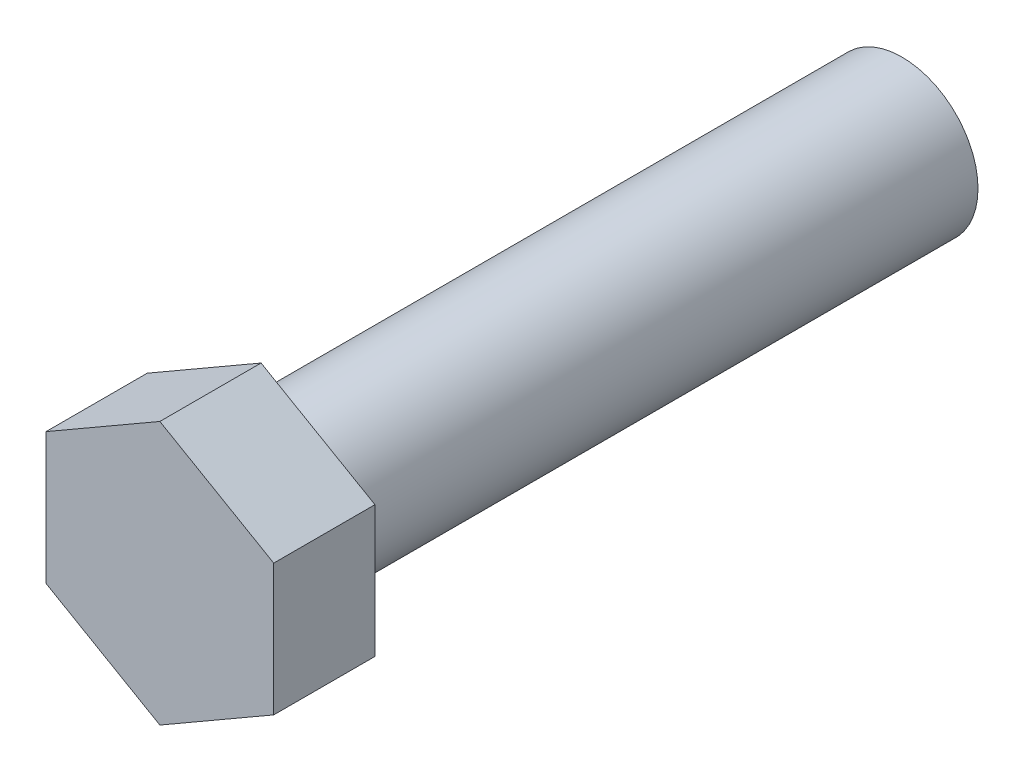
ISO-10303-21;
HEADER;
FILE_DESCRIPTION(('STEP AP214'),'2;1');
FILE_NAME('part.step','',(''),(''),'','','');
FILE_SCHEMA(('AUTOMOTIVE_DESIGN { 1 0 10303 214 1 1 1 1 }'));
ENDSEC;
DATA;
#1=APPLICATION_CONTEXT('core data for automotive mechanical design processes');
#2=APPLICATION_PROTOCOL_DEFINITION('international standard','automotive_design',2000,#1);
#3=PRODUCT_CONTEXT('',#1,'mechanical');
#4=PRODUCT('Part','Part','',(#3));
#5=PRODUCT_RELATED_PRODUCT_CATEGORY('part','',(#4));
#6=PRODUCT_DEFINITION_FORMATION('','',#4);
#7=PRODUCT_DEFINITION_CONTEXT('part definition',#1,'design');
#8=PRODUCT_DEFINITION('design','',#6,#7);
#9=PRODUCT_DEFINITION_SHAPE('','',#8);
#10=(LENGTH_UNIT() NAMED_UNIT(*) SI_UNIT(.MILLI.,.METRE.));
#11=(NAMED_UNIT(*) PLANE_ANGLE_UNIT() SI_UNIT($,.RADIAN.));
#12=(NAMED_UNIT(*) SI_UNIT($,.STERADIAN.) SOLID_ANGLE_UNIT());
#13=UNCERTAINTY_MEASURE_WITH_UNIT(LENGTH_MEASURE(1.E-05),#10,'distance_accuracy_value','');
#14=(GEOMETRIC_REPRESENTATION_CONTEXT(3) GLOBAL_UNCERTAINTY_ASSIGNED_CONTEXT((#13)) GLOBAL_UNIT_ASSIGNED_CONTEXT((#10,
#11,#12)) REPRESENTATION_CONTEXT('',''));
#15=CARTESIAN_POINT('',(0.,0.,0.));
#16=DIRECTION('',(0.,0.,1.));
#17=DIRECTION('',(1.,0.,0.));
#18=AXIS2_PLACEMENT_3D('',#15,#16,#17);
#19=CARTESIAN_POINT('',(42.8625,24.7466759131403,38.1));
#20=DIRECTION('',(-0.5,-0.866025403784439,0.));
#21=DIRECTION('',(0.866025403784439,-0.5,0.));
#22=AXIS2_PLACEMENT_3D('',#19,#20,#21);
#23=PLANE('',#22);
#24=DIRECTION('',(-0.866025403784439,0.5,0.));
#25=VECTOR('',#24,1.);
#26=CARTESIAN_POINT('',(42.8625,24.7466759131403,0.));
#27=LINE('',#26,#25);
#28=CARTESIAN_POINT('',(42.8625,24.7466759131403,0.));
#29=VERTEX_POINT('',#28);
#30=CARTESIAN_POINT('',(0.,49.4933518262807,0.));
#31=VERTEX_POINT('',#30);
#32=EDGE_CURVE('E131',#29,#31,#27,.T.);
#33=ORIENTED_EDGE('',*,*,#32,.T.);
#34=DIRECTION('',(0.,0.,-1.));
#35=VECTOR('',#34,1.);
#36=CARTESIAN_POINT('',(0.,49.4933518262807,38.1));
#37=LINE('',#36,#35);
#38=CARTESIAN_POINT('',(0.,49.4933518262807,38.1));
#39=VERTEX_POINT('',#38);
#40=EDGE_CURVE('E11',#39,#31,#37,.T.);
#41=ORIENTED_EDGE('',*,*,#40,.F.);
#42=DIRECTION('',(-0.866025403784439,0.5,0.));
#43=VECTOR('',#42,1.);
#44=CARTESIAN_POINT('',(42.8625,24.7466759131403,38.1));
#45=LINE('',#44,#43);
#46=CARTESIAN_POINT('',(42.8625,24.7466759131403,38.1));
#47=VERTEX_POINT('',#46);
#48=EDGE_CURVE('E151',#47,#39,#45,.T.);
#49=ORIENTED_EDGE('',*,*,#48,.F.);
#50=DIRECTION('',(0.,0.,-1.));
#51=VECTOR('',#50,1.);
#52=CARTESIAN_POINT('',(42.8625,24.7466759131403,38.1));
#53=LINE('',#52,#51);
#54=EDGE_CURVE('E128',#47,#29,#53,.T.);
#55=ORIENTED_EDGE('',*,*,#54,.T.);
#56=EDGE_LOOP('',(#33,#41,#49,#55));
#57=FACE_BOUND('',#56,.T.);
#58=ADVANCED_FACE('F44',(#57),#23,.F.);
#59=CARTESIAN_POINT('',(0.,49.4933518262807,38.1));
#60=DIRECTION('',(0.5,-0.866025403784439,0.));
#61=DIRECTION('',(0.866025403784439,0.5,0.));
#62=AXIS2_PLACEMENT_3D('',#59,#60,#61);
#63=PLANE('',#62);
#64=DIRECTION('',(-0.866025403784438,-0.5,0.));
#65=VECTOR('',#64,1.);
#66=CARTESIAN_POINT('',(0.,49.4933518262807,0.));
#67=LINE('',#66,#65);
#68=CARTESIAN_POINT('',(-42.8625000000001,24.7466759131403,0.));
#69=VERTEX_POINT('',#68);
#70=EDGE_CURVE('E136',#31,#69,#67,.T.);
#71=ORIENTED_EDGE('',*,*,#70,.T.);
#72=DIRECTION('',(0.,0.,-1.));
#73=VECTOR('',#72,1.);
#74=CARTESIAN_POINT('',(-42.8625000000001,24.7466759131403,38.1));
#75=LINE('',#74,#73);
#76=CARTESIAN_POINT('',(-42.8625000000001,24.7466759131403,38.1));
#77=VERTEX_POINT('',#76);
#78=EDGE_CURVE('E53',#77,#69,#75,.T.);
#79=ORIENTED_EDGE('',*,*,#78,.F.);
#80=DIRECTION('',(-0.866025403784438,-0.5,0.));
#81=VECTOR('',#80,1.);
#82=CARTESIAN_POINT('',(0.,49.4933518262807,38.1));
#83=LINE('',#82,#81);
#84=EDGE_CURVE('E97',#39,#77,#83,.T.);
#85=ORIENTED_EDGE('',*,*,#84,.F.);
#86=ORIENTED_EDGE('',*,*,#40,.T.);
#87=EDGE_LOOP('',(#71,#79,#85,#86));
#88=FACE_BOUND('',#87,.T.);
#89=ADVANCED_FACE('F179',(#88),#63,.F.);
#90=CARTESIAN_POINT('',(-42.8625000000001,24.7466759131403,38.1));
#91=DIRECTION('',(1.,0.,0.));
#92=DIRECTION('',(0.,1.,0.));
#93=AXIS2_PLACEMENT_3D('',#90,#91,#92);
#94=PLANE('',#93);
#95=DIRECTION('',(0.,-1.,0.));
#96=VECTOR('',#95,1.);
#97=CARTESIAN_POINT('',(-42.8625000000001,24.7466759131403,0.));
#98=LINE('',#97,#96);
#99=CARTESIAN_POINT('',(-42.8625,-24.7466759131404,0.));
#100=VERTEX_POINT('',#99);
#101=EDGE_CURVE('E142',#69,#100,#98,.T.);
#102=ORIENTED_EDGE('',*,*,#101,.T.);
#103=DIRECTION('',(0.,0.,-1.));
#104=VECTOR('',#103,1.);
#105=CARTESIAN_POINT('',(-42.8625,-24.7466759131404,38.1));
#106=LINE('',#105,#104);
#107=CARTESIAN_POINT('',(-42.8625,-24.7466759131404,38.1));
#108=VERTEX_POINT('',#107);
#109=EDGE_CURVE('E121',#108,#100,#106,.T.);
#110=ORIENTED_EDGE('',*,*,#109,.F.);
#111=DIRECTION('',(0.,-1.,0.));
#112=VECTOR('',#111,1.);
#113=CARTESIAN_POINT('',(-42.8625000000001,24.7466759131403,38.1));
#114=LINE('',#113,#112);
#115=EDGE_CURVE('E115',#77,#108,#114,.T.);
#116=ORIENTED_EDGE('',*,*,#115,.F.);
#117=ORIENTED_EDGE('',*,*,#78,.T.);
#118=EDGE_LOOP('',(#102,#110,#116,#117));
#119=FACE_BOUND('',#118,.T.);
#120=ADVANCED_FACE('F161',(#119),#94,.F.);
#121=CARTESIAN_POINT('',(-42.8625,-24.7466759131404,38.1));
#122=DIRECTION('',(0.5,0.866025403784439,0.));
#123=DIRECTION('',(-0.866025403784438,0.5,0.));
#124=AXIS2_PLACEMENT_3D('',#121,#122,#123);
#125=PLANE('',#124);
#126=DIRECTION('',(0.866025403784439,-0.5,0.));
#127=VECTOR('',#126,1.);
#128=CARTESIAN_POINT('',(-42.8625,-24.7466759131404,0.));
#129=LINE('',#128,#127);
#130=CARTESIAN_POINT('',(0.,-49.4933518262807,0.));
#131=VERTEX_POINT('',#130);
#132=EDGE_CURVE('E123',#100,#131,#129,.T.);
#133=ORIENTED_EDGE('',*,*,#132,.T.);
#134=DIRECTION('',(0.,0.,-1.));
#135=VECTOR('',#134,1.);
#136=CARTESIAN_POINT('',(0.,-49.4933518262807,38.1));
#137=LINE('',#136,#135);
#138=CARTESIAN_POINT('',(0.,-49.4933518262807,38.1));
#139=VERTEX_POINT('',#138);
#140=EDGE_CURVE('E120',#139,#131,#137,.T.);
#141=ORIENTED_EDGE('',*,*,#140,.F.);
#142=DIRECTION('',(0.866025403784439,-0.5,0.));
#143=VECTOR('',#142,1.);
#144=CARTESIAN_POINT('',(-42.8625,-24.7466759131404,38.1));
#145=LINE('',#144,#143);
#146=EDGE_CURVE('E106',#108,#139,#145,.T.);
#147=ORIENTED_EDGE('',*,*,#146,.F.);
#148=ORIENTED_EDGE('',*,*,#109,.T.);
#149=EDGE_LOOP('',(#133,#141,#147,#148));
#150=FACE_BOUND('',#149,.T.);
#151=ADVANCED_FACE('F116',(#150),#125,.F.);
#152=CARTESIAN_POINT('',(0.,-49.4933518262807,38.1));
#153=DIRECTION('',(-0.5,0.866025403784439,0.));
#154=DIRECTION('',(-0.866025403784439,-0.5,0.));
#155=AXIS2_PLACEMENT_3D('',#152,#153,#154);
#156=PLANE('',#155);
#157=DIRECTION('',(0.866025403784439,0.5,0.));
#158=VECTOR('',#157,1.);
#159=CARTESIAN_POINT('',(0.,-49.4933518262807,0.));
#160=LINE('',#159,#158);
#161=CARTESIAN_POINT('',(42.8625,-24.7466759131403,0.));
#162=VERTEX_POINT('',#161);
#163=EDGE_CURVE('E82',#131,#162,#160,.T.);
#164=ORIENTED_EDGE('',*,*,#163,.T.);
#165=DIRECTION('',(0.,0.,-1.));
#166=VECTOR('',#165,1.);
#167=CARTESIAN_POINT('',(42.8625,-24.7466759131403,38.1));
#168=LINE('',#167,#166);
#169=CARTESIAN_POINT('',(42.8625,-24.7466759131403,38.1));
#170=VERTEX_POINT('',#169);
#171=EDGE_CURVE('E124',#170,#162,#168,.T.);
#172=ORIENTED_EDGE('',*,*,#171,.F.);
#173=DIRECTION('',(0.866025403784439,0.5,0.));
#174=VECTOR('',#173,1.);
#175=CARTESIAN_POINT('',(0.,-49.4933518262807,38.1));
#176=LINE('',#175,#174);
#177=EDGE_CURVE('E109',#139,#170,#176,.T.);
#178=ORIENTED_EDGE('',*,*,#177,.F.);
#179=ORIENTED_EDGE('',*,*,#140,.T.);
#180=EDGE_LOOP('',(#164,#172,#178,#179));
#181=FACE_BOUND('',#180,.T.);
#182=ADVANCED_FACE('F127',(#181),#156,.F.);
#183=CARTESIAN_POINT('',(42.8625,-24.7466759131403,38.1));
#184=DIRECTION('',(-1.,0.,0.));
#185=DIRECTION('',(0.,-1.,0.));
#186=AXIS2_PLACEMENT_3D('',#183,#184,#185);
#187=PLANE('',#186);
#188=DIRECTION('',(0.,1.,0.));
#189=VECTOR('',#188,1.);
#190=CARTESIAN_POINT('',(42.8625,-24.7466759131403,0.));
#191=LINE('',#190,#189);
#192=EDGE_CURVE('E93',#162,#29,#191,.T.);
#193=ORIENTED_EDGE('',*,*,#192,.T.);
#194=ORIENTED_EDGE('',*,*,#54,.F.);
#195=DIRECTION('',(0.,1.,0.));
#196=VECTOR('',#195,1.);
#197=CARTESIAN_POINT('',(42.8625,-24.7466759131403,38.1));
#198=LINE('',#197,#196);
#199=EDGE_CURVE('E64',#170,#47,#198,.T.);
#200=ORIENTED_EDGE('',*,*,#199,.F.);
#201=ORIENTED_EDGE('',*,*,#171,.T.);
#202=EDGE_LOOP('',(#193,#194,#200,#201));
#203=FACE_BOUND('',#202,.T.);
#204=ADVANCED_FACE('F169',(#203),#187,.F.);
#205=CARTESIAN_POINT('',(0.,0.,38.1));
#206=DIRECTION('',(0.,0.,1.));
#207=DIRECTION('',(1.,0.,0.));
#208=AXIS2_PLACEMENT_3D('',#205,#206,#207);
#209=PLANE('',#208);
#210=ORIENTED_EDGE('',*,*,#48,.T.);
#211=ORIENTED_EDGE('',*,*,#84,.T.);
#212=ORIENTED_EDGE('',*,*,#115,.T.);
#213=ORIENTED_EDGE('',*,*,#146,.T.);
#214=ORIENTED_EDGE('',*,*,#177,.T.);
#215=ORIENTED_EDGE('',*,*,#199,.T.);
#216=EDGE_LOOP('',(#210,#211,#212,#213,#214,#215));
#217=FACE_BOUND('',#216,.T.);
#218=ADVANCED_FACE('F107',(#217),#209,.T.);
#219=CARTESIAN_POINT('',(0.,0.,0.));
#220=DIRECTION('',(0.,0.,1.));
#221=DIRECTION('',(1.,0.,0.));
#222=AXIS2_PLACEMENT_3D('',#219,#220,#221);
#223=PLANE('',#222);
#224=CARTESIAN_POINT('',(0.,0.,0.));
#225=DIRECTION('',(0.,0.,1.));
#226=DIRECTION('',(1.,0.,0.));
#227=AXIS2_PLACEMENT_3D('',#224,#225,#226);
#228=CIRCLE('',#227,28.575);
#229=CARTESIAN_POINT('',(28.575,0.,0.));
#230=VERTEX_POINT('',#229);
#231=EDGE_CURVE('E245',#230,#230,#228,.T.);
#232=ORIENTED_EDGE('',*,*,#231,.T.);
#233=EDGE_LOOP('',(#232));
#234=FACE_BOUND('',#233,.T.);
#235=ORIENTED_EDGE('',*,*,#32,.F.);
#236=ORIENTED_EDGE('',*,*,#192,.F.);
#237=ORIENTED_EDGE('',*,*,#163,.F.);
#238=ORIENTED_EDGE('',*,*,#132,.F.);
#239=ORIENTED_EDGE('',*,*,#101,.F.);
#240=ORIENTED_EDGE('',*,*,#70,.F.);
#241=EDGE_LOOP('',(#235,#236,#237,#238,#239,#240));
#242=FACE_BOUND('',#241,.T.);
#243=ADVANCED_FACE('F163',(#234,#242),#223,.F.);
#244=CARTESIAN_POINT('',(0.,0.,-241.3));
#245=DIRECTION('',(0.,0.,1.));
#246=DIRECTION('',(1.,0.,0.));
#247=AXIS2_PLACEMENT_3D('',#244,#245,#246);
#248=CYLINDRICAL_SURFACE('',#247,28.575);
#249=CARTESIAN_POINT('',(0.,0.,-241.3));
#250=DIRECTION('',(0.,0.,1.));
#251=DIRECTION('',(1.,0.,0.));
#252=AXIS2_PLACEMENT_3D('',#249,#250,#251);
#253=CIRCLE('',#252,28.575);
#254=CARTESIAN_POINT('',(28.575,0.,-241.3));
#255=VERTEX_POINT('',#254);
#256=EDGE_CURVE('E139',#255,#255,#253,.T.);
#257=ORIENTED_EDGE('',*,*,#256,.T.);
#258=EDGE_LOOP('',(#257));
#259=FACE_BOUND('',#258,.T.);
#260=ORIENTED_EDGE('',*,*,#231,.F.);
#261=EDGE_LOOP('',(#260));
#262=FACE_BOUND('',#261,.T.);
#263=ADVANCED_FACE('F217',(#259,#262),#248,.T.);
#264=CARTESIAN_POINT('',(0.,0.,-241.3));
#265=DIRECTION('',(0.,0.,1.));
#266=DIRECTION('',(1.,0.,0.));
#267=AXIS2_PLACEMENT_3D('',#264,#265,#266);
#268=PLANE('',#267);
#269=ORIENTED_EDGE('',*,*,#256,.F.);
#270=EDGE_LOOP('',(#269));
#271=FACE_BOUND('',#270,.T.);
#272=ADVANCED_FACE('F229',(#271),#268,.F.);
#273=CLOSED_SHELL('',(#58,#89,#120,#151,#182,#204,#218,#243,#263,#272));
#274=MANIFOLD_SOLID_BREP('B2',#273);
#275=ADVANCED_BREP_SHAPE_REPRESENTATION('',(#18,#274),#14);
#276=SHAPE_DEFINITION_REPRESENTATION(#9,#275);
ENDSEC;
END-ISO-10303-21;
